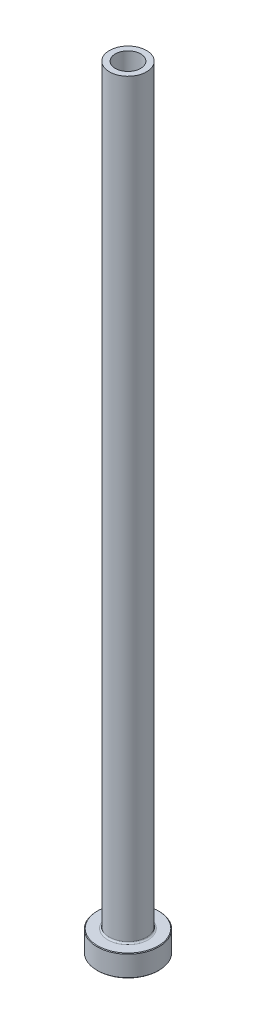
ISO-10303-21;
HEADER;
FILE_DESCRIPTION(('STEP AP214'),'2;1');
FILE_NAME('part.step','',(''),(''),'','','');
FILE_SCHEMA(('AUTOMOTIVE_DESIGN { 1 0 10303 214 1 1 1 1 }'));
ENDSEC;
DATA;
#1=APPLICATION_CONTEXT('core data for automotive mechanical design processes');
#2=APPLICATION_PROTOCOL_DEFINITION('international standard','automotive_design',2000,#1);
#3=PRODUCT_CONTEXT('',#1,'mechanical');
#4=PRODUCT('Part','Part','',(#3));
#5=PRODUCT_RELATED_PRODUCT_CATEGORY('part','',(#4));
#6=PRODUCT_DEFINITION_FORMATION('','',#4);
#7=PRODUCT_DEFINITION_CONTEXT('part definition',#1,'design');
#8=PRODUCT_DEFINITION('design','',#6,#7);
#9=PRODUCT_DEFINITION_SHAPE('','',#8);
#10=(LENGTH_UNIT() NAMED_UNIT(*) SI_UNIT(.MILLI.,.METRE.));
#11=(NAMED_UNIT(*) PLANE_ANGLE_UNIT() SI_UNIT($,.RADIAN.));
#12=(NAMED_UNIT(*) SI_UNIT($,.STERADIAN.) SOLID_ANGLE_UNIT());
#13=UNCERTAINTY_MEASURE_WITH_UNIT(LENGTH_MEASURE(1.E-05),#10,'distance_accuracy_value','');
#14=(GEOMETRIC_REPRESENTATION_CONTEXT(3) GLOBAL_UNCERTAINTY_ASSIGNED_CONTEXT((#13)) GLOBAL_UNIT_ASSIGNED_CONTEXT((#10,
#11,#12)) REPRESENTATION_CONTEXT('',''));
#15=CARTESIAN_POINT('',(0.,0.,0.));
#16=DIRECTION('',(0.,0.,1.));
#17=DIRECTION('',(1.,0.,0.));
#18=AXIS2_PLACEMENT_3D('',#15,#16,#17);
#19=CARTESIAN_POINT('',(0.,92.1876809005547,0.));
#20=DIRECTION('',(0.,1.,0.));
#21=DIRECTION('',(0.,0.,1.));
#22=AXIS2_PLACEMENT_3D('',#19,#20,#21);
#23=CYLINDRICAL_SURFACE('',#22,4.10000000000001);
#24=CARTESIAN_POINT('',(0.,250.,0.));
#25=DIRECTION('',(0.,1.,0.));
#26=DIRECTION('',(0.,0.,1.));
#27=AXIS2_PLACEMENT_3D('',#24,#25,#26);
#28=CIRCLE('',#27,4.10000000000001);
#29=CARTESIAN_POINT('',(0.,250.,4.10000000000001));
#30=VERTEX_POINT('',#29);
#31=EDGE_CURVE('E62',#30,#30,#28,.T.);
#32=ORIENTED_EDGE('',*,*,#31,.T.);
#33=EDGE_LOOP('',(#32));
#34=FACE_BOUND('',#33,.T.);
#35=CARTESIAN_POINT('',(0.,205.,0.));
#36=DIRECTION('',(0.,1.,0.));
#37=DIRECTION('',(0.,0.,1.));
#38=AXIS2_PLACEMENT_3D('',#35,#36,#37);
#39=CIRCLE('',#38,4.10000000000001);
#40=CARTESIAN_POINT('',(0.,205.,4.10000000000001));
#41=VERTEX_POINT('',#40);
#42=EDGE_CURVE('E71',#41,#41,#39,.T.);
#43=ORIENTED_EDGE('',*,*,#42,.F.);
#44=EDGE_LOOP('',(#43));
#45=FACE_BOUND('',#44,.T.);
#46=ADVANCED_FACE('F30',(#34,#45),#23,.F.);
#47=CARTESIAN_POINT('',(-4.10000000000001,250.,0.));
#48=DIRECTION('',(0.,1.,0.));
#49=DIRECTION('',(0.,0.,1.));
#50=AXIS2_PLACEMENT_3D('',#47,#48,#49);
#51=PLANE('',#50);
#52=CARTESIAN_POINT('',(0.,250.,0.));
#53=DIRECTION('',(0.,1.,0.));
#54=DIRECTION('',(0.,0.,1.));
#55=AXIS2_PLACEMENT_3D('',#52,#53,#54);
#56=CIRCLE('',#55,6.00000000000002);
#57=CARTESIAN_POINT('',(0.,250.,6.00000000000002));
#58=VERTEX_POINT('',#57);
#59=EDGE_CURVE('E65',#58,#58,#56,.T.);
#60=ORIENTED_EDGE('',*,*,#59,.T.);
#61=EDGE_LOOP('',(#60));
#62=FACE_BOUND('',#61,.T.);
#63=ORIENTED_EDGE('',*,*,#31,.F.);
#64=EDGE_LOOP('',(#63));
#65=FACE_BOUND('',#64,.T.);
#66=ADVANCED_FACE('F79',(#62,#65),#51,.T.);
#67=CARTESIAN_POINT('',(0.,92.1876809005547,0.));
#68=DIRECTION('',(0.,1.,0.));
#69=DIRECTION('',(0.,0.,1.));
#70=AXIS2_PLACEMENT_3D('',#67,#68,#69);
#71=CYLINDRICAL_SURFACE('',#70,6.);
#72=CARTESIAN_POINT('',(0.,7.50000000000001,0.));
#73=DIRECTION('',(0.,1.,0.));
#74=DIRECTION('',(0.,0.,1.));
#75=AXIS2_PLACEMENT_3D('',#72,#73,#74);
#76=CIRCLE('',#75,6.);
#77=CARTESIAN_POINT('',(0.,7.50000000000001,6.));
#78=VERTEX_POINT('',#77);
#79=EDGE_CURVE('E59',#78,#78,#76,.T.);
#80=ORIENTED_EDGE('',*,*,#79,.T.);
#81=EDGE_LOOP('',(#80));
#82=FACE_BOUND('',#81,.T.);
#83=ORIENTED_EDGE('',*,*,#59,.F.);
#84=EDGE_LOOP('',(#83));
#85=FACE_BOUND('',#84,.T.);
#86=ADVANCED_FACE('F85',(#82,#85),#71,.T.);
#87=CARTESIAN_POINT('',(-5.99999999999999,7.,0.));
#88=DIRECTION('',(0.,1.,0.));
#89=DIRECTION('',(0.,0.,1.));
#90=AXIS2_PLACEMENT_3D('',#87,#88,#89);
#91=PLANE('',#90);
#92=CARTESIAN_POINT('',(0.,7.,0.));
#93=DIRECTION('',(0.,1.,0.));
#94=DIRECTION('',(0.,0.,1.));
#95=AXIS2_PLACEMENT_3D('',#92,#93,#94);
#96=CIRCLE('',#95,9.79999999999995);
#97=CARTESIAN_POINT('',(0.,7.,9.79999999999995));
#98=VERTEX_POINT('',#97);
#99=EDGE_CURVE('E53',#98,#98,#96,.T.);
#100=ORIENTED_EDGE('',*,*,#99,.T.);
#101=EDGE_LOOP('',(#100));
#102=FACE_BOUND('',#101,.T.);
#103=CARTESIAN_POINT('',(0.,7.,0.));
#104=DIRECTION('',(0.,1.,0.));
#105=DIRECTION('',(0.,0.,1.));
#106=AXIS2_PLACEMENT_3D('',#103,#104,#105);
#107=CIRCLE('',#106,6.5);
#108=CARTESIAN_POINT('',(0.,7.,6.5));
#109=VERTEX_POINT('',#108);
#110=EDGE_CURVE('E56',#109,#109,#107,.F.);
#111=ORIENTED_EDGE('',*,*,#110,.T.);
#112=EDGE_LOOP('',(#111));
#113=FACE_BOUND('',#112,.T.);
#114=ADVANCED_FACE('F111',(#102,#113),#91,.T.);
#115=CARTESIAN_POINT('',(0.,92.1876809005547,0.));
#116=DIRECTION('',(0.,1.,0.));
#117=DIRECTION('',(0.,0.,1.));
#118=AXIS2_PLACEMENT_3D('',#115,#116,#117);
#119=CYLINDRICAL_SURFACE('',#118,9.99999999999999);
#120=CARTESIAN_POINT('',(0.,6.8,0.));
#121=DIRECTION('',(0.,1.,0.));
#122=DIRECTION('',(0.,0.,1.));
#123=AXIS2_PLACEMENT_3D('',#120,#121,#122);
#124=CIRCLE('',#123,9.99999999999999);
#125=CARTESIAN_POINT('',(0.,6.8,9.99999999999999));
#126=VERTEX_POINT('',#125);
#127=EDGE_CURVE('E45',#126,#126,#124,.F.);
#128=ORIENTED_EDGE('',*,*,#127,.T.);
#129=EDGE_LOOP('',(#128));
#130=FACE_BOUND('',#129,.T.);
#131=CARTESIAN_POINT('',(0.,0.200000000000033,0.));
#132=DIRECTION('',(0.,-1.,0.));
#133=DIRECTION('',(0.,0.,-1.));
#134=AXIS2_PLACEMENT_3D('',#131,#132,#133);
#135=CIRCLE('',#134,9.99999999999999);
#136=CARTESIAN_POINT('',(0.,0.200000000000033,-9.99999999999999));
#137=VERTEX_POINT('',#136);
#138=EDGE_CURVE('E50',#137,#137,#135,.F.);
#139=ORIENTED_EDGE('',*,*,#138,.T.);
#140=EDGE_LOOP('',(#139));
#141=FACE_BOUND('',#140,.T.);
#142=ADVANCED_FACE('F108',(#130,#141),#119,.T.);
#143=CARTESIAN_POINT('',(-9.99999999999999,0.,0.));
#144=DIRECTION('',(0.,-1.,0.));
#145=DIRECTION('',(0.,0.,-1.));
#146=AXIS2_PLACEMENT_3D('',#143,#144,#145);
#147=PLANE('',#146);
#148=CARTESIAN_POINT('',(0.,0.,0.));
#149=DIRECTION('',(0.,-1.,0.));
#150=DIRECTION('',(0.,0.,-1.));
#151=AXIS2_PLACEMENT_3D('',#148,#149,#150);
#152=CIRCLE('',#151,4.84999999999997);
#153=CARTESIAN_POINT('',(0.,0.,-4.84999999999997));
#154=VERTEX_POINT('',#153);
#155=EDGE_CURVE('E37',#154,#154,#152,.F.);
#156=ORIENTED_EDGE('',*,*,#155,.T.);
#157=EDGE_LOOP('',(#156));
#158=FACE_BOUND('',#157,.T.);
#159=CARTESIAN_POINT('',(0.,0.,0.));
#160=DIRECTION('',(0.,-1.,0.));
#161=DIRECTION('',(0.,0.,-1.));
#162=AXIS2_PLACEMENT_3D('',#159,#160,#161);
#163=CIRCLE('',#162,9.79999999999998);
#164=CARTESIAN_POINT('',(0.,0.,-9.79999999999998));
#165=VERTEX_POINT('',#164);
#166=EDGE_CURVE('E41',#165,#165,#163,.T.);
#167=ORIENTED_EDGE('',*,*,#166,.T.);
#168=EDGE_LOOP('',(#167));
#169=FACE_BOUND('',#168,.T.);
#170=ADVANCED_FACE('F110',(#158,#169),#147,.T.);
#171=CARTESIAN_POINT('',(0.,92.1876809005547,0.));
#172=DIRECTION('',(0.,1.,0.));
#173=DIRECTION('',(0.,0.,1.));
#174=AXIS2_PLACEMENT_3D('',#171,#172,#173);
#175=CYLINDRICAL_SURFACE('',#174,4.35);
#176=CARTESIAN_POINT('',(0.,0.499999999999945,0.));
#177=DIRECTION('',(0.,-1.,0.));
#178=DIRECTION('',(0.,0.,-1.));
#179=AXIS2_PLACEMENT_3D('',#176,#177,#178);
#180=CIRCLE('',#179,4.35);
#181=CARTESIAN_POINT('',(0.,0.499999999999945,-4.35));
#182=VERTEX_POINT('',#181);
#183=EDGE_CURVE('E10',#182,#182,#180,.T.);
#184=ORIENTED_EDGE('',*,*,#183,.T.);
#185=EDGE_LOOP('',(#184));
#186=FACE_BOUND('',#185,.T.);
#187=CARTESIAN_POINT('',(0.,193.,0.));
#188=DIRECTION('',(0.,1.,0.));
#189=DIRECTION('',(0.,0.,1.));
#190=AXIS2_PLACEMENT_3D('',#187,#188,#189);
#191=CIRCLE('',#190,4.35000000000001);
#192=CARTESIAN_POINT('',(0.,193.,4.35000000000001));
#193=VERTEX_POINT('',#192);
#194=EDGE_CURVE('E68',#193,#193,#191,.T.);
#195=ORIENTED_EDGE('',*,*,#194,.T.);
#196=EDGE_LOOP('',(#195));
#197=FACE_BOUND('',#196,.T.);
#198=ADVANCED_FACE('F118',(#186,#197),#175,.F.);
#199=CARTESIAN_POINT('',(0.,193.,0.));
#200=DIRECTION('',(0.,-1.,0.));
#201=DIRECTION('',(0.,0.,-1.));
#202=AXIS2_PLACEMENT_3D('',#199,#200,#201);
#203=CONICAL_SURFACE('',#202,4.35000000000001,0.0208303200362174);
#204=ORIENTED_EDGE('',*,*,#42,.T.);
#205=EDGE_LOOP('',(#204));
#206=FACE_BOUND('',#205,.T.);
#207=ORIENTED_EDGE('',*,*,#194,.F.);
#208=EDGE_LOOP('',(#207));
#209=FACE_BOUND('',#208,.T.);
#210=ADVANCED_FACE('F75',(#206,#209),#203,.F.);
#211=CARTESIAN_POINT('',(0.,7.50000000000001,0.));
#212=DIRECTION('',(0.,1.,0.));
#213=DIRECTION('',(0.,0.,1.));
#214=AXIS2_PLACEMENT_3D('',#211,#212,#213);
#215=TOROIDAL_SURFACE('',#214,6.5,0.5);
#216=ORIENTED_EDGE('',*,*,#110,.F.);
#217=EDGE_LOOP('',(#216));
#218=FACE_BOUND('',#217,.T.);
#219=ORIENTED_EDGE('',*,*,#79,.F.);
#220=EDGE_LOOP('',(#219));
#221=FACE_BOUND('',#220,.T.);
#222=ADVANCED_FACE('F90',(#218,#221),#215,.F.);
#223=CARTESIAN_POINT('',(0.,7.00000000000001,0.));
#224=DIRECTION('',(0.,-1.,0.));
#225=DIRECTION('',(0.,0.,-1.));
#226=AXIS2_PLACEMENT_3D('',#223,#224,#225);
#227=CONICAL_SURFACE('',#226,9.79999999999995,0.785398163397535);
#228=ORIENTED_EDGE('',*,*,#127,.F.);
#229=EDGE_LOOP('',(#228));
#230=FACE_BOUND('',#229,.T.);
#231=ORIENTED_EDGE('',*,*,#99,.F.);
#232=EDGE_LOOP('',(#231));
#233=FACE_BOUND('',#232,.T.);
#234=ADVANCED_FACE('F93',(#230,#233),#227,.T.);
#235=CARTESIAN_POINT('',(0.,0.200000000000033,0.));
#236=DIRECTION('',(0.,1.,0.));
#237=DIRECTION('',(0.,0.,1.));
#238=AXIS2_PLACEMENT_3D('',#235,#236,#237);
#239=CONICAL_SURFACE('',#238,9.99999999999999,0.785398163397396);
#240=ORIENTED_EDGE('',*,*,#166,.F.);
#241=EDGE_LOOP('',(#240));
#242=FACE_BOUND('',#241,.T.);
#243=ORIENTED_EDGE('',*,*,#138,.F.);
#244=EDGE_LOOP('',(#243));
#245=FACE_BOUND('',#244,.T.);
#246=ADVANCED_FACE('F96',(#242,#245),#239,.T.);
#247=CARTESIAN_POINT('',(0.,0.,0.));
#248=DIRECTION('',(0.,-1.,0.));
#249=DIRECTION('',(0.,0.,-1.));
#250=AXIS2_PLACEMENT_3D('',#247,#248,#249);
#251=CONICAL_SURFACE('',#250,4.84999999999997,0.785398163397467);
#252=ORIENTED_EDGE('',*,*,#183,.F.);
#253=EDGE_LOOP('',(#252));
#254=FACE_BOUND('',#253,.T.);
#255=ORIENTED_EDGE('',*,*,#155,.F.);
#256=EDGE_LOOP('',(#255));
#257=FACE_BOUND('',#256,.T.);
#258=ADVANCED_FACE('F32',(#254,#257),#251,.F.);
#259=CLOSED_SHELL('',(#46,#66,#86,#114,#142,#170,#198,#210,#222,#234,#246,#258));
#260=MANIFOLD_SOLID_BREP('B2',#259);
#261=ADVANCED_BREP_SHAPE_REPRESENTATION('',(#18,#260),#14);
#262=SHAPE_DEFINITION_REPRESENTATION(#9,#261);
ENDSEC;
END-ISO-10303-21;
